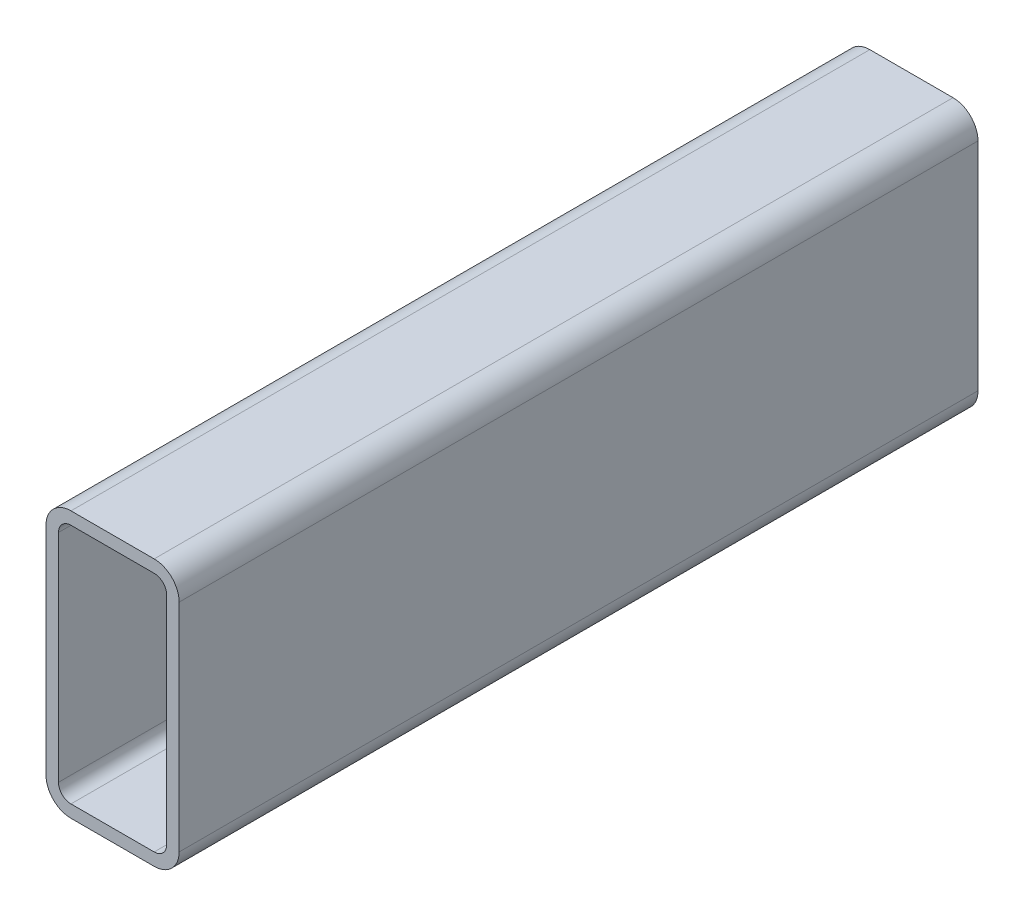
ISO-10303-21;
HEADER;
FILE_DESCRIPTION(('STEP AP214'),'2;1');
FILE_NAME('part.step','',(''),(''),'','','');
FILE_SCHEMA(('AUTOMOTIVE_DESIGN { 1 0 10303 214 1 1 1 1 }'));
ENDSEC;
DATA;
#1=APPLICATION_CONTEXT('core data for automotive mechanical design processes');
#2=APPLICATION_PROTOCOL_DEFINITION('international standard','automotive_design',2000,#1);
#3=PRODUCT_CONTEXT('',#1,'mechanical');
#4=PRODUCT('Part','Part','',(#3));
#5=PRODUCT_RELATED_PRODUCT_CATEGORY('part','',(#4));
#6=PRODUCT_DEFINITION_FORMATION('','',#4);
#7=PRODUCT_DEFINITION_CONTEXT('part definition',#1,'design');
#8=PRODUCT_DEFINITION('design','',#6,#7);
#9=PRODUCT_DEFINITION_SHAPE('','',#8);
#10=(LENGTH_UNIT() NAMED_UNIT(*) SI_UNIT(.MILLI.,.METRE.));
#11=(NAMED_UNIT(*) PLANE_ANGLE_UNIT() SI_UNIT($,.RADIAN.));
#12=(NAMED_UNIT(*) SI_UNIT($,.STERADIAN.) SOLID_ANGLE_UNIT());
#13=UNCERTAINTY_MEASURE_WITH_UNIT(LENGTH_MEASURE(1.E-05),#10,'distance_accuracy_value','');
#14=(GEOMETRIC_REPRESENTATION_CONTEXT(3) GLOBAL_UNCERTAINTY_ASSIGNED_CONTEXT((#13)) GLOBAL_UNIT_ASSIGNED_CONTEXT((#10,
#11,#12)) REPRESENTATION_CONTEXT('',''));
#15=CARTESIAN_POINT('',(0.,0.,0.));
#16=DIRECTION('',(0.,0.,1.));
#17=DIRECTION('',(1.,0.,0.));
#18=AXIS2_PLACEMENT_3D('',#15,#16,#17);
#19=CARTESIAN_POINT('',(9.52499999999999,92.075,304.8));
#20=DIRECTION('',(0.,0.,1.));
#21=DIRECTION('',(1.,0.,0.));
#22=AXIS2_PLACEMENT_3D('',#19,#20,#21);
#23=PLANE('',#22);
#24=CARTESIAN_POINT('',(9.52499999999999,92.075,304.8));
#25=DIRECTION('',(0.,0.,1.));
#26=DIRECTION('',(1.,0.,0.));
#27=AXIS2_PLACEMENT_3D('',#24,#25,#26);
#28=CIRCLE('',#27,9.52499999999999);
#29=CARTESIAN_POINT('',(9.525,101.6,304.8));
#30=VERTEX_POINT('',#29);
#31=CARTESIAN_POINT('',(0.,92.075,304.8));
#32=VERTEX_POINT('',#31);
#33=EDGE_CURVE('E211',#30,#32,#28,.T.);
#34=ORIENTED_EDGE('',*,*,#33,.T.);
#35=DIRECTION('',(0.,-1.,0.));
#36=VECTOR('',#35,1.);
#37=CARTESIAN_POINT('',(0.,9.525,304.8));
#38=LINE('',#37,#36);
#39=CARTESIAN_POINT('',(0.,9.525,304.8));
#40=VERTEX_POINT('',#39);
#41=EDGE_CURVE('E214',#32,#40,#38,.T.);
#42=ORIENTED_EDGE('',*,*,#41,.T.);
#43=CARTESIAN_POINT('',(9.52499999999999,9.52499999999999,304.8));
#44=DIRECTION('',(0.,0.,1.));
#45=DIRECTION('',(1.,0.,0.));
#46=AXIS2_PLACEMENT_3D('',#43,#44,#45);
#47=CIRCLE('',#46,9.52499999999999);
#48=CARTESIAN_POINT('',(9.525,0.,304.8));
#49=VERTEX_POINT('',#48);
#50=EDGE_CURVE('E217',#40,#49,#47,.T.);
#51=ORIENTED_EDGE('',*,*,#50,.T.);
#52=DIRECTION('',(1.,0.,0.));
#53=VECTOR('',#52,1.);
#54=CARTESIAN_POINT('',(41.275,0.,304.8));
#55=LINE('',#54,#53);
#56=CARTESIAN_POINT('',(41.275,0.,304.8));
#57=VERTEX_POINT('',#56);
#58=EDGE_CURVE('E219',#49,#57,#55,.T.);
#59=ORIENTED_EDGE('',*,*,#58,.T.);
#60=CARTESIAN_POINT('',(41.275,9.52499999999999,304.8));
#61=DIRECTION('',(0.,0.,1.));
#62=DIRECTION('',(1.,0.,0.));
#63=AXIS2_PLACEMENT_3D('',#60,#61,#62);
#64=CIRCLE('',#63,9.52499999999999);
#65=CARTESIAN_POINT('',(50.8,9.525,304.8));
#66=VERTEX_POINT('',#65);
#67=EDGE_CURVE('E221',#57,#66,#64,.T.);
#68=ORIENTED_EDGE('',*,*,#67,.T.);
#69=DIRECTION('',(0.,1.,0.));
#70=VECTOR('',#69,1.);
#71=CARTESIAN_POINT('',(50.8,92.075,304.8));
#72=LINE('',#71,#70);
#73=CARTESIAN_POINT('',(50.8,92.075,304.8));
#74=VERTEX_POINT('',#73);
#75=EDGE_CURVE('E223',#66,#74,#72,.T.);
#76=ORIENTED_EDGE('',*,*,#75,.T.);
#77=CARTESIAN_POINT('',(41.275,92.075,304.8));
#78=DIRECTION('',(0.,0.,1.));
#79=DIRECTION('',(1.,0.,0.));
#80=AXIS2_PLACEMENT_3D('',#77,#78,#79);
#81=CIRCLE('',#80,9.525);
#82=CARTESIAN_POINT('',(41.275,101.6,304.8));
#83=VERTEX_POINT('',#82);
#84=EDGE_CURVE('E225',#74,#83,#81,.T.);
#85=ORIENTED_EDGE('',*,*,#84,.T.);
#86=DIRECTION('',(-1.,0.,0.));
#87=VECTOR('',#86,1.);
#88=CARTESIAN_POINT('',(9.525,101.6,304.8));
#89=LINE('',#88,#87);
#90=EDGE_CURVE('E227',#83,#30,#89,.T.);
#91=ORIENTED_EDGE('',*,*,#90,.T.);
#92=EDGE_LOOP('',(#34,#42,#51,#59,#68,#76,#85,#91));
#93=FACE_BOUND('',#92,.T.);
#94=DIRECTION('',(0.,-1.,0.));
#95=VECTOR('',#94,1.);
#96=CARTESIAN_POINT('',(4.7625,9.525,304.8));
#97=LINE('',#96,#95);
#98=CARTESIAN_POINT('',(4.7625,92.075,304.8));
#99=VERTEX_POINT('',#98);
#100=CARTESIAN_POINT('',(4.7625,9.525,304.8));
#101=VERTEX_POINT('',#100);
#102=EDGE_CURVE('E154',#99,#101,#97,.T.);
#103=ORIENTED_EDGE('',*,*,#102,.F.);
#104=CARTESIAN_POINT('',(9.52499999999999,92.075,304.8));
#105=DIRECTION('',(0.,0.,1.));
#106=DIRECTION('',(1.,0.,0.));
#107=AXIS2_PLACEMENT_3D('',#104,#105,#106);
#108=CIRCLE('',#107,4.76249999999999);
#109=CARTESIAN_POINT('',(9.525,96.8375,304.8));
#110=VERTEX_POINT('',#109);
#111=EDGE_CURVE('E146',#110,#99,#108,.T.);
#112=ORIENTED_EDGE('',*,*,#111,.F.);
#113=DIRECTION('',(-1.,0.,0.));
#114=VECTOR('',#113,1.);
#115=CARTESIAN_POINT('',(9.525,96.8375,304.8));
#116=LINE('',#115,#114);
#117=CARTESIAN_POINT('',(41.275,96.8375,304.8));
#118=VERTEX_POINT('',#117);
#119=EDGE_CURVE('E179',#118,#110,#116,.T.);
#120=ORIENTED_EDGE('',*,*,#119,.F.);
#121=CARTESIAN_POINT('',(41.275,92.075,304.8));
#122=DIRECTION('',(0.,0.,1.));
#123=DIRECTION('',(1.,0.,0.));
#124=AXIS2_PLACEMENT_3D('',#121,#122,#123);
#125=CIRCLE('',#124,4.7625);
#126=CARTESIAN_POINT('',(46.0375,92.075,304.8));
#127=VERTEX_POINT('',#126);
#128=EDGE_CURVE('E177',#127,#118,#125,.T.);
#129=ORIENTED_EDGE('',*,*,#128,.F.);
#130=DIRECTION('',(0.,1.,0.));
#131=VECTOR('',#130,1.);
#132=CARTESIAN_POINT('',(46.0375,92.075,304.8));
#133=LINE('',#132,#131);
#134=CARTESIAN_POINT('',(46.0375,9.525,304.8));
#135=VERTEX_POINT('',#134);
#136=EDGE_CURVE('E175',#135,#127,#133,.T.);
#137=ORIENTED_EDGE('',*,*,#136,.F.);
#138=CARTESIAN_POINT('',(41.275,9.52499999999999,304.8));
#139=DIRECTION('',(0.,0.,1.));
#140=DIRECTION('',(1.,0.,0.));
#141=AXIS2_PLACEMENT_3D('',#138,#139,#140);
#142=CIRCLE('',#141,4.76249999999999);
#143=CARTESIAN_POINT('',(41.275,4.7625,304.8));
#144=VERTEX_POINT('',#143);
#145=EDGE_CURVE('E173',#144,#135,#142,.T.);
#146=ORIENTED_EDGE('',*,*,#145,.F.);
#147=DIRECTION('',(1.,0.,0.));
#148=VECTOR('',#147,1.);
#149=CARTESIAN_POINT('',(41.275,4.7625,304.8));
#150=LINE('',#149,#148);
#151=CARTESIAN_POINT('',(9.525,4.7625,304.8));
#152=VERTEX_POINT('',#151);
#153=EDGE_CURVE('E169',#152,#144,#150,.T.);
#154=ORIENTED_EDGE('',*,*,#153,.F.);
#155=CARTESIAN_POINT('',(9.52499999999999,9.52499999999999,304.8));
#156=DIRECTION('',(0.,0.,1.));
#157=DIRECTION('',(1.,0.,0.));
#158=AXIS2_PLACEMENT_3D('',#155,#156,#157);
#159=CIRCLE('',#158,4.76249999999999);
#160=EDGE_CURVE('E167',#101,#152,#159,.T.);
#161=ORIENTED_EDGE('',*,*,#160,.F.);
#162=EDGE_LOOP('',(#103,#112,#120,#129,#137,#146,#154,#161));
#163=FACE_BOUND('',#162,.T.);
#164=ADVANCED_FACE('F33',(#93,#163),#23,.T.);
#165=CARTESIAN_POINT('',(9.52499999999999,92.075,0.));
#166=DIRECTION('',(0.,0.,1.));
#167=DIRECTION('',(1.,0.,0.));
#168=AXIS2_PLACEMENT_3D('',#165,#166,#167);
#169=PLANE('',#168);
#170=CARTESIAN_POINT('',(9.52499999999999,92.075,0.));
#171=DIRECTION('',(0.,0.,1.));
#172=DIRECTION('',(1.,0.,0.));
#173=AXIS2_PLACEMENT_3D('',#170,#171,#172);
#174=CIRCLE('',#173,9.52499999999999);
#175=CARTESIAN_POINT('',(9.525,101.6,0.));
#176=VERTEX_POINT('',#175);
#177=CARTESIAN_POINT('',(0.,92.075,0.));
#178=VERTEX_POINT('',#177);
#179=EDGE_CURVE('E162',#176,#178,#174,.T.);
#180=ORIENTED_EDGE('',*,*,#179,.F.);
#181=DIRECTION('',(-1.,0.,0.));
#182=VECTOR('',#181,1.);
#183=CARTESIAN_POINT('',(9.525,101.6,0.));
#184=LINE('',#183,#182);
#185=CARTESIAN_POINT('',(41.275,101.6,0.));
#186=VERTEX_POINT('',#185);
#187=EDGE_CURVE('E215',#186,#176,#184,.T.);
#188=ORIENTED_EDGE('',*,*,#187,.F.);
#189=CARTESIAN_POINT('',(41.275,92.075,0.));
#190=DIRECTION('',(0.,0.,1.));
#191=DIRECTION('',(1.,0.,0.));
#192=AXIS2_PLACEMENT_3D('',#189,#190,#191);
#193=CIRCLE('',#192,9.525);
#194=CARTESIAN_POINT('',(50.8,92.075,0.));
#195=VERTEX_POINT('',#194);
#196=EDGE_CURVE('E242',#195,#186,#193,.T.);
#197=ORIENTED_EDGE('',*,*,#196,.F.);
#198=DIRECTION('',(0.,1.,0.));
#199=VECTOR('',#198,1.);
#200=CARTESIAN_POINT('',(50.8,92.075,0.));
#201=LINE('',#200,#199);
#202=CARTESIAN_POINT('',(50.8,9.525,0.));
#203=VERTEX_POINT('',#202);
#204=EDGE_CURVE('E240',#203,#195,#201,.T.);
#205=ORIENTED_EDGE('',*,*,#204,.F.);
#206=CARTESIAN_POINT('',(41.275,9.52499999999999,0.));
#207=DIRECTION('',(0.,0.,1.));
#208=DIRECTION('',(1.,0.,0.));
#209=AXIS2_PLACEMENT_3D('',#206,#207,#208);
#210=CIRCLE('',#209,9.52499999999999);
#211=CARTESIAN_POINT('',(41.275,0.,0.));
#212=VERTEX_POINT('',#211);
#213=EDGE_CURVE('E238',#212,#203,#210,.T.);
#214=ORIENTED_EDGE('',*,*,#213,.F.);
#215=DIRECTION('',(1.,0.,0.));
#216=VECTOR('',#215,1.);
#217=CARTESIAN_POINT('',(41.275,0.,0.));
#218=LINE('',#217,#216);
#219=CARTESIAN_POINT('',(9.525,0.,0.));
#220=VERTEX_POINT('',#219);
#221=EDGE_CURVE('E236',#220,#212,#218,.T.);
#222=ORIENTED_EDGE('',*,*,#221,.F.);
#223=CARTESIAN_POINT('',(9.52499999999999,9.52499999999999,0.));
#224=DIRECTION('',(0.,0.,1.));
#225=DIRECTION('',(1.,0.,0.));
#226=AXIS2_PLACEMENT_3D('',#223,#224,#225);
#227=CIRCLE('',#226,9.52499999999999);
#228=CARTESIAN_POINT('',(0.,9.525,0.));
#229=VERTEX_POINT('',#228);
#230=EDGE_CURVE('E234',#229,#220,#227,.T.);
#231=ORIENTED_EDGE('',*,*,#230,.F.);
#232=DIRECTION('',(0.,-1.,0.));
#233=VECTOR('',#232,1.);
#234=CARTESIAN_POINT('',(0.,9.525,0.));
#235=LINE('',#234,#233);
#236=EDGE_CURVE('E232',#178,#229,#235,.T.);
#237=ORIENTED_EDGE('',*,*,#236,.F.);
#238=EDGE_LOOP('',(#180,#188,#197,#205,#214,#222,#231,#237));
#239=FACE_BOUND('',#238,.T.);
#240=CARTESIAN_POINT('',(9.52499999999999,92.075,0.));
#241=DIRECTION('',(0.,0.,1.));
#242=DIRECTION('',(1.,0.,0.));
#243=AXIS2_PLACEMENT_3D('',#240,#241,#242);
#244=CIRCLE('',#243,4.76249999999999);
#245=CARTESIAN_POINT('',(9.525,96.8375,0.));
#246=VERTEX_POINT('',#245);
#247=CARTESIAN_POINT('',(4.7625,92.075,0.));
#248=VERTEX_POINT('',#247);
#249=EDGE_CURVE('E56',#246,#248,#244,.T.);
#250=ORIENTED_EDGE('',*,*,#249,.T.);
#251=DIRECTION('',(0.,-1.,0.));
#252=VECTOR('',#251,1.);
#253=CARTESIAN_POINT('',(4.7625,9.525,0.));
#254=LINE('',#253,#252);
#255=CARTESIAN_POINT('',(4.7625,9.525,0.));
#256=VERTEX_POINT('',#255);
#257=EDGE_CURVE('E161',#248,#256,#254,.T.);
#258=ORIENTED_EDGE('',*,*,#257,.T.);
#259=CARTESIAN_POINT('',(9.52499999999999,9.52499999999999,0.));
#260=DIRECTION('',(0.,0.,1.));
#261=DIRECTION('',(1.,0.,0.));
#262=AXIS2_PLACEMENT_3D('',#259,#260,#261);
#263=CIRCLE('',#262,4.76249999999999);
#264=CARTESIAN_POINT('',(9.525,4.7625,0.));
#265=VERTEX_POINT('',#264);
#266=EDGE_CURVE('E183',#256,#265,#263,.T.);
#267=ORIENTED_EDGE('',*,*,#266,.T.);
#268=DIRECTION('',(1.,0.,0.));
#269=VECTOR('',#268,1.);
#270=CARTESIAN_POINT('',(41.275,4.7625,0.));
#271=LINE('',#270,#269);
#272=CARTESIAN_POINT('',(41.275,4.7625,0.));
#273=VERTEX_POINT('',#272);
#274=EDGE_CURVE('E186',#265,#273,#271,.T.);
#275=ORIENTED_EDGE('',*,*,#274,.T.);
#276=CARTESIAN_POINT('',(41.275,9.52499999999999,0.));
#277=DIRECTION('',(0.,0.,1.));
#278=DIRECTION('',(1.,0.,0.));
#279=AXIS2_PLACEMENT_3D('',#276,#277,#278);
#280=CIRCLE('',#279,4.76249999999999);
#281=CARTESIAN_POINT('',(46.0375,9.525,0.));
#282=VERTEX_POINT('',#281);
#283=EDGE_CURVE('E189',#273,#282,#280,.T.);
#284=ORIENTED_EDGE('',*,*,#283,.T.);
#285=DIRECTION('',(0.,1.,0.));
#286=VECTOR('',#285,1.);
#287=CARTESIAN_POINT('',(46.0375,92.075,0.));
#288=LINE('',#287,#286);
#289=CARTESIAN_POINT('',(46.0375,92.075,0.));
#290=VERTEX_POINT('',#289);
#291=EDGE_CURVE('E192',#282,#290,#288,.T.);
#292=ORIENTED_EDGE('',*,*,#291,.T.);
#293=CARTESIAN_POINT('',(41.275,92.075,0.));
#294=DIRECTION('',(0.,0.,1.));
#295=DIRECTION('',(1.,0.,0.));
#296=AXIS2_PLACEMENT_3D('',#293,#294,#295);
#297=CIRCLE('',#296,4.7625);
#298=CARTESIAN_POINT('',(41.275,96.8375,0.));
#299=VERTEX_POINT('',#298);
#300=EDGE_CURVE('E195',#290,#299,#297,.T.);
#301=ORIENTED_EDGE('',*,*,#300,.T.);
#302=DIRECTION('',(-1.,0.,0.));
#303=VECTOR('',#302,1.);
#304=CARTESIAN_POINT('',(9.525,96.8375,0.));
#305=LINE('',#304,#303);
#306=EDGE_CURVE('E155',#299,#246,#305,.T.);
#307=ORIENTED_EDGE('',*,*,#306,.T.);
#308=EDGE_LOOP('',(#250,#258,#267,#275,#284,#292,#301,#307));
#309=FACE_BOUND('',#308,.T.);
#310=ADVANCED_FACE('F272',(#239,#309),#169,.F.);
#311=CARTESIAN_POINT('',(9.52499999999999,92.075,304.8));
#312=DIRECTION('',(0.,0.,-1.));
#313=DIRECTION('',(-1.,0.,0.));
#314=AXIS2_PLACEMENT_3D('',#311,#312,#313);
#315=CYLINDRICAL_SURFACE('',#314,9.52499999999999);
#316=ORIENTED_EDGE('',*,*,#179,.T.);
#317=DIRECTION('',(0.,0.,-1.));
#318=VECTOR('',#317,1.);
#319=CARTESIAN_POINT('',(0.,92.075,304.8));
#320=LINE('',#319,#318);
#321=EDGE_CURVE('E11',#32,#178,#320,.T.);
#322=ORIENTED_EDGE('',*,*,#321,.F.);
#323=ORIENTED_EDGE('',*,*,#33,.F.);
#324=DIRECTION('',(0.,0.,-1.));
#325=VECTOR('',#324,1.);
#326=CARTESIAN_POINT('',(9.525,101.6,304.8));
#327=LINE('',#326,#325);
#328=EDGE_CURVE('E229',#30,#176,#327,.T.);
#329=ORIENTED_EDGE('',*,*,#328,.T.);
#330=EDGE_LOOP('',(#316,#322,#323,#329));
#331=FACE_BOUND('',#330,.T.);
#332=ADVANCED_FACE('F35',(#331),#315,.T.);
#333=CARTESIAN_POINT('',(0.,9.525,304.8));
#334=DIRECTION('',(1.,0.,0.));
#335=DIRECTION('',(0.,0.,-1.));
#336=AXIS2_PLACEMENT_3D('',#333,#334,#335);
#337=PLANE('',#336);
#338=ORIENTED_EDGE('',*,*,#236,.T.);
#339=DIRECTION('',(0.,0.,-1.));
#340=VECTOR('',#339,1.);
#341=CARTESIAN_POINT('',(0.,9.525,304.8));
#342=LINE('',#341,#340);
#343=EDGE_CURVE('E41',#40,#229,#342,.T.);
#344=ORIENTED_EDGE('',*,*,#343,.F.);
#345=ORIENTED_EDGE('',*,*,#41,.F.);
#346=ORIENTED_EDGE('',*,*,#321,.T.);
#347=EDGE_LOOP('',(#338,#344,#345,#346));
#348=FACE_BOUND('',#347,.T.);
#349=ADVANCED_FACE('F289',(#348),#337,.F.);
#350=CARTESIAN_POINT('',(9.52499999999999,9.52499999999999,304.8));
#351=DIRECTION('',(0.,0.,-1.));
#352=DIRECTION('',(-1.,0.,0.));
#353=AXIS2_PLACEMENT_3D('',#350,#351,#352);
#354=CYLINDRICAL_SURFACE('',#353,9.52499999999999);
#355=ORIENTED_EDGE('',*,*,#230,.T.);
#356=DIRECTION('',(0.,0.,-1.));
#357=VECTOR('',#356,1.);
#358=CARTESIAN_POINT('',(9.525,0.,304.8));
#359=LINE('',#358,#357);
#360=EDGE_CURVE('E259',#49,#220,#359,.T.);
#361=ORIENTED_EDGE('',*,*,#360,.F.);
#362=ORIENTED_EDGE('',*,*,#50,.F.);
#363=ORIENTED_EDGE('',*,*,#343,.T.);
#364=EDGE_LOOP('',(#355,#361,#362,#363));
#365=FACE_BOUND('',#364,.T.);
#366=ADVANCED_FACE('F266',(#365),#354,.T.);
#367=CARTESIAN_POINT('',(41.275,0.,304.8));
#368=DIRECTION('',(0.,1.,0.));
#369=DIRECTION('',(0.,0.,1.));
#370=AXIS2_PLACEMENT_3D('',#367,#368,#369);
#371=PLANE('',#370);
#372=ORIENTED_EDGE('',*,*,#221,.T.);
#373=DIRECTION('',(0.,0.,-1.));
#374=VECTOR('',#373,1.);
#375=CARTESIAN_POINT('',(41.275,0.,304.8));
#376=LINE('',#375,#374);
#377=EDGE_CURVE('E256',#57,#212,#376,.T.);
#378=ORIENTED_EDGE('',*,*,#377,.F.);
#379=ORIENTED_EDGE('',*,*,#58,.F.);
#380=ORIENTED_EDGE('',*,*,#360,.T.);
#381=EDGE_LOOP('',(#372,#378,#379,#380));
#382=FACE_BOUND('',#381,.T.);
#383=ADVANCED_FACE('F278',(#382),#371,.F.);
#384=CARTESIAN_POINT('',(41.275,9.52499999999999,304.8));
#385=DIRECTION('',(0.,0.,-1.));
#386=DIRECTION('',(-1.,0.,0.));
#387=AXIS2_PLACEMENT_3D('',#384,#385,#386);
#388=CYLINDRICAL_SURFACE('',#387,9.52499999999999);
#389=ORIENTED_EDGE('',*,*,#213,.T.);
#390=DIRECTION('',(0.,0.,-1.));
#391=VECTOR('',#390,1.);
#392=CARTESIAN_POINT('',(50.8,9.525,304.8));
#393=LINE('',#392,#391);
#394=EDGE_CURVE('E253',#66,#203,#393,.T.);
#395=ORIENTED_EDGE('',*,*,#394,.F.);
#396=ORIENTED_EDGE('',*,*,#67,.F.);
#397=ORIENTED_EDGE('',*,*,#377,.T.);
#398=EDGE_LOOP('',(#389,#395,#396,#397));
#399=FACE_BOUND('',#398,.T.);
#400=ADVANCED_FACE('F282',(#399),#388,.T.);
#401=CARTESIAN_POINT('',(50.8,92.075,304.8));
#402=DIRECTION('',(-1.,0.,0.));
#403=DIRECTION('',(0.,0.,1.));
#404=AXIS2_PLACEMENT_3D('',#401,#402,#403);
#405=PLANE('',#404);
#406=ORIENTED_EDGE('',*,*,#204,.T.);
#407=DIRECTION('',(0.,0.,-1.));
#408=VECTOR('',#407,1.);
#409=CARTESIAN_POINT('',(50.8,92.075,304.8));
#410=LINE('',#409,#408);
#411=EDGE_CURVE('E250',#74,#195,#410,.T.);
#412=ORIENTED_EDGE('',*,*,#411,.F.);
#413=ORIENTED_EDGE('',*,*,#75,.F.);
#414=ORIENTED_EDGE('',*,*,#394,.T.);
#415=EDGE_LOOP('',(#406,#412,#413,#414));
#416=FACE_BOUND('',#415,.T.);
#417=ADVANCED_FACE('F302',(#416),#405,.F.);
#418=CARTESIAN_POINT('',(41.275,92.075,304.8));
#419=DIRECTION('',(0.,0.,-1.));
#420=DIRECTION('',(-1.,0.,0.));
#421=AXIS2_PLACEMENT_3D('',#418,#419,#420);
#422=CYLINDRICAL_SURFACE('',#421,9.525);
#423=ORIENTED_EDGE('',*,*,#196,.T.);
#424=DIRECTION('',(0.,0.,-1.));
#425=VECTOR('',#424,1.);
#426=CARTESIAN_POINT('',(41.275,101.6,304.8));
#427=LINE('',#426,#425);
#428=EDGE_CURVE('E247',#83,#186,#427,.T.);
#429=ORIENTED_EDGE('',*,*,#428,.F.);
#430=ORIENTED_EDGE('',*,*,#84,.F.);
#431=ORIENTED_EDGE('',*,*,#411,.T.);
#432=EDGE_LOOP('',(#423,#429,#430,#431));
#433=FACE_BOUND('',#432,.T.);
#434=ADVANCED_FACE('F300',(#433),#422,.T.);
#435=CARTESIAN_POINT('',(9.525,101.6,304.8));
#436=DIRECTION('',(0.,-1.,0.));
#437=DIRECTION('',(0.,0.,-1.));
#438=AXIS2_PLACEMENT_3D('',#435,#436,#437);
#439=PLANE('',#438);
#440=ORIENTED_EDGE('',*,*,#187,.T.);
#441=ORIENTED_EDGE('',*,*,#328,.F.);
#442=ORIENTED_EDGE('',*,*,#90,.F.);
#443=ORIENTED_EDGE('',*,*,#428,.T.);
#444=EDGE_LOOP('',(#440,#441,#442,#443));
#445=FACE_BOUND('',#444,.T.);
#446=ADVANCED_FACE('F295',(#445),#439,.F.);
#447=CARTESIAN_POINT('',(9.52499999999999,92.075,304.8));
#448=DIRECTION('',(0.,0.,-1.));
#449=DIRECTION('',(-1.,0.,0.));
#450=AXIS2_PLACEMENT_3D('',#447,#448,#449);
#451=CYLINDRICAL_SURFACE('',#450,4.76249999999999);
#452=ORIENTED_EDGE('',*,*,#249,.F.);
#453=DIRECTION('',(0.,0.,-1.));
#454=VECTOR('',#453,1.);
#455=CARTESIAN_POINT('',(9.525,96.8375,304.8));
#456=LINE('',#455,#454);
#457=EDGE_CURVE('E150',#110,#246,#456,.T.);
#458=ORIENTED_EDGE('',*,*,#457,.F.);
#459=ORIENTED_EDGE('',*,*,#111,.T.);
#460=DIRECTION('',(0.,0.,-1.));
#461=VECTOR('',#460,1.);
#462=CARTESIAN_POINT('',(4.7625,92.075,304.8));
#463=LINE('',#462,#461);
#464=EDGE_CURVE('E149',#99,#248,#463,.T.);
#465=ORIENTED_EDGE('',*,*,#464,.T.);
#466=EDGE_LOOP('',(#452,#458,#459,#465));
#467=FACE_BOUND('',#466,.T.);
#468=ADVANCED_FACE('F148',(#467),#451,.F.);
#469=CARTESIAN_POINT('',(4.7625,9.525,304.8));
#470=DIRECTION('',(1.,0.,0.));
#471=DIRECTION('',(0.,0.,-1.));
#472=AXIS2_PLACEMENT_3D('',#469,#470,#471);
#473=PLANE('',#472);
#474=ORIENTED_EDGE('',*,*,#257,.F.);
#475=ORIENTED_EDGE('',*,*,#464,.F.);
#476=ORIENTED_EDGE('',*,*,#102,.T.);
#477=DIRECTION('',(0.,0.,-1.));
#478=VECTOR('',#477,1.);
#479=CARTESIAN_POINT('',(4.7625,9.525,304.8));
#480=LINE('',#479,#478);
#481=EDGE_CURVE('E163',#101,#256,#480,.T.);
#482=ORIENTED_EDGE('',*,*,#481,.T.);
#483=EDGE_LOOP('',(#474,#475,#476,#482));
#484=FACE_BOUND('',#483,.T.);
#485=ADVANCED_FACE('F158',(#484),#473,.T.);
#486=CARTESIAN_POINT('',(9.52499999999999,9.52499999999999,304.8));
#487=DIRECTION('',(0.,0.,-1.));
#488=DIRECTION('',(-1.,0.,0.));
#489=AXIS2_PLACEMENT_3D('',#486,#487,#488);
#490=CYLINDRICAL_SURFACE('',#489,4.76249999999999);
#491=ORIENTED_EDGE('',*,*,#266,.F.);
#492=ORIENTED_EDGE('',*,*,#481,.F.);
#493=ORIENTED_EDGE('',*,*,#160,.T.);
#494=DIRECTION('',(0.,0.,-1.));
#495=VECTOR('',#494,1.);
#496=CARTESIAN_POINT('',(9.525,4.7625,304.8));
#497=LINE('',#496,#495);
#498=EDGE_CURVE('E208',#152,#265,#497,.T.);
#499=ORIENTED_EDGE('',*,*,#498,.T.);
#500=EDGE_LOOP('',(#491,#492,#493,#499));
#501=FACE_BOUND('',#500,.T.);
#502=ADVANCED_FACE('F327',(#501),#490,.F.);
#503=CARTESIAN_POINT('',(41.275,4.7625,304.8));
#504=DIRECTION('',(0.,1.,0.));
#505=DIRECTION('',(0.,0.,1.));
#506=AXIS2_PLACEMENT_3D('',#503,#504,#505);
#507=PLANE('',#506);
#508=ORIENTED_EDGE('',*,*,#274,.F.);
#509=ORIENTED_EDGE('',*,*,#498,.F.);
#510=ORIENTED_EDGE('',*,*,#153,.T.);
#511=DIRECTION('',(0.,0.,-1.));
#512=VECTOR('',#511,1.);
#513=CARTESIAN_POINT('',(41.275,4.7625,304.8));
#514=LINE('',#513,#512);
#515=EDGE_CURVE('E206',#144,#273,#514,.T.);
#516=ORIENTED_EDGE('',*,*,#515,.T.);
#517=EDGE_LOOP('',(#508,#509,#510,#516));
#518=FACE_BOUND('',#517,.T.);
#519=ADVANCED_FACE('F331',(#518),#507,.T.);
#520=CARTESIAN_POINT('',(41.275,9.52499999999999,304.8));
#521=DIRECTION('',(0.,0.,-1.));
#522=DIRECTION('',(-1.,0.,0.));
#523=AXIS2_PLACEMENT_3D('',#520,#521,#522);
#524=CYLINDRICAL_SURFACE('',#523,4.76249999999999);
#525=ORIENTED_EDGE('',*,*,#283,.F.);
#526=ORIENTED_EDGE('',*,*,#515,.F.);
#527=ORIENTED_EDGE('',*,*,#145,.T.);
#528=DIRECTION('',(0.,0.,-1.));
#529=VECTOR('',#528,1.);
#530=CARTESIAN_POINT('',(46.0375,9.525,304.8));
#531=LINE('',#530,#529);
#532=EDGE_CURVE('E204',#135,#282,#531,.T.);
#533=ORIENTED_EDGE('',*,*,#532,.T.);
#534=EDGE_LOOP('',(#525,#526,#527,#533));
#535=FACE_BOUND('',#534,.T.);
#536=ADVANCED_FACE('F337',(#535),#524,.F.);
#537=CARTESIAN_POINT('',(46.0375,92.075,304.8));
#538=DIRECTION('',(-1.,0.,0.));
#539=DIRECTION('',(0.,0.,1.));
#540=AXIS2_PLACEMENT_3D('',#537,#538,#539);
#541=PLANE('',#540);
#542=ORIENTED_EDGE('',*,*,#291,.F.);
#543=ORIENTED_EDGE('',*,*,#532,.F.);
#544=ORIENTED_EDGE('',*,*,#136,.T.);
#545=DIRECTION('',(0.,0.,-1.));
#546=VECTOR('',#545,1.);
#547=CARTESIAN_POINT('',(46.0375,92.075,304.8));
#548=LINE('',#547,#546);
#549=EDGE_CURVE('E202',#127,#290,#548,.T.);
#550=ORIENTED_EDGE('',*,*,#549,.T.);
#551=EDGE_LOOP('',(#542,#543,#544,#550));
#552=FACE_BOUND('',#551,.T.);
#553=ADVANCED_FACE('F341',(#552),#541,.T.);
#554=CARTESIAN_POINT('',(41.275,92.075,304.8));
#555=DIRECTION('',(0.,0.,-1.));
#556=DIRECTION('',(-1.,0.,0.));
#557=AXIS2_PLACEMENT_3D('',#554,#555,#556);
#558=CYLINDRICAL_SURFACE('',#557,4.7625);
#559=ORIENTED_EDGE('',*,*,#300,.F.);
#560=ORIENTED_EDGE('',*,*,#549,.F.);
#561=ORIENTED_EDGE('',*,*,#128,.T.);
#562=DIRECTION('',(0.,0.,-1.));
#563=VECTOR('',#562,1.);
#564=CARTESIAN_POINT('',(41.275,96.8375,304.8));
#565=LINE('',#564,#563);
#566=EDGE_CURVE('E48',#118,#299,#565,.T.);
#567=ORIENTED_EDGE('',*,*,#566,.T.);
#568=EDGE_LOOP('',(#559,#560,#561,#567));
#569=FACE_BOUND('',#568,.T.);
#570=ADVANCED_FACE('F345',(#569),#558,.F.);
#571=CARTESIAN_POINT('',(9.525,96.8375,304.8));
#572=DIRECTION('',(0.,-1.,0.));
#573=DIRECTION('',(0.,0.,-1.));
#574=AXIS2_PLACEMENT_3D('',#571,#572,#573);
#575=PLANE('',#574);
#576=ORIENTED_EDGE('',*,*,#306,.F.);
#577=ORIENTED_EDGE('',*,*,#566,.F.);
#578=ORIENTED_EDGE('',*,*,#119,.T.);
#579=ORIENTED_EDGE('',*,*,#457,.T.);
#580=EDGE_LOOP('',(#576,#577,#578,#579));
#581=FACE_BOUND('',#580,.T.);
#582=ADVANCED_FACE('F349',(#581),#575,.T.);
#583=CLOSED_SHELL('',(#164,#310,#332,#349,#366,#383,#400,#417,#434,#446,#468,#485,#502,#519,
#536,#553,#570,#582));
#584=MANIFOLD_SOLID_BREP('B2',#583);
#585=ADVANCED_BREP_SHAPE_REPRESENTATION('',(#18,#584),#14);
#586=SHAPE_DEFINITION_REPRESENTATION(#9,#585);
ENDSEC;
END-ISO-10303-21;
